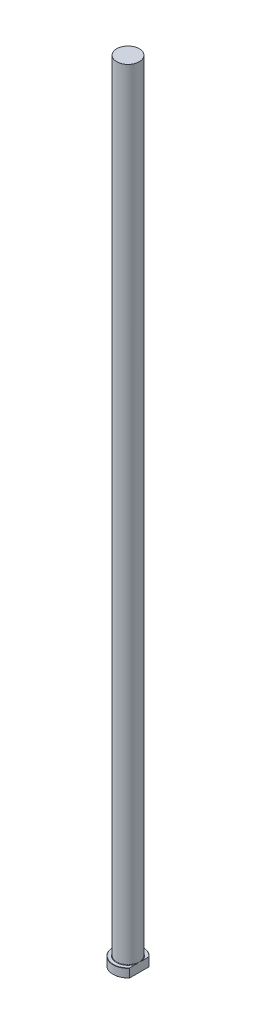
ISO-10303-21;
HEADER;
FILE_DESCRIPTION(('STEP AP214'),'2;1');
FILE_NAME('part.step','',(''),(''),'','','');
FILE_SCHEMA(('AUTOMOTIVE_DESIGN { 1 0 10303 214 1 1 1 1 }'));
ENDSEC;
DATA;
#1=APPLICATION_CONTEXT('core data for automotive mechanical design processes');
#2=APPLICATION_PROTOCOL_DEFINITION('international standard','automotive_design',2000,#1);
#3=PRODUCT_CONTEXT('',#1,'mechanical');
#4=PRODUCT('Part','Part','',(#3));
#5=PRODUCT_RELATED_PRODUCT_CATEGORY('part','',(#4));
#6=PRODUCT_DEFINITION_FORMATION('','',#4);
#7=PRODUCT_DEFINITION_CONTEXT('part definition',#1,'design');
#8=PRODUCT_DEFINITION('design','',#6,#7);
#9=PRODUCT_DEFINITION_SHAPE('','',#8);
#10=(LENGTH_UNIT() NAMED_UNIT(*) SI_UNIT(.MILLI.,.METRE.));
#11=(NAMED_UNIT(*) PLANE_ANGLE_UNIT() SI_UNIT($,.RADIAN.));
#12=(NAMED_UNIT(*) SI_UNIT($,.STERADIAN.) SOLID_ANGLE_UNIT());
#13=UNCERTAINTY_MEASURE_WITH_UNIT(LENGTH_MEASURE(1.E-05),#10,'distance_accuracy_value','');
#14=(GEOMETRIC_REPRESENTATION_CONTEXT(3) GLOBAL_UNCERTAINTY_ASSIGNED_CONTEXT((#13)) GLOBAL_UNIT_ASSIGNED_CONTEXT((#10,
#11,#12)) REPRESENTATION_CONTEXT('',''));
#15=CARTESIAN_POINT('',(0.,0.,0.));
#16=DIRECTION('',(0.,0.,1.));
#17=DIRECTION('',(1.,0.,0.));
#18=AXIS2_PLACEMENT_3D('',#15,#16,#17);
#19=CARTESIAN_POINT('',(0.,0.,0.));
#20=DIRECTION('',(0.,-1.,0.));
#21=DIRECTION('',(0.,0.,-1.));
#22=AXIS2_PLACEMENT_3D('',#19,#20,#21);
#23=PLANE('',#22);
#24=CARTESIAN_POINT('',(0.,0.,0.));
#25=DIRECTION('',(0.,-1.,0.));
#26=DIRECTION('',(0.,0.,-1.));
#27=AXIS2_PLACEMENT_3D('',#24,#25,#26);
#28=CIRCLE('',#27,11.7999999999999);
#29=CARTESIAN_POINT('',(8.99999999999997,0.,7.63151361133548));
#30=VERTEX_POINT('',#29);
#31=CARTESIAN_POINT('',(8.99999999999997,0.,-7.63151361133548));
#32=VERTEX_POINT('',#31);
#33=EDGE_CURVE('E98',#30,#32,#28,.T.);
#34=ORIENTED_EDGE('',*,*,#33,.T.);
#35=DIRECTION('',(0.,0.,1.));
#36=VECTOR('',#35,1.);
#37=CARTESIAN_POINT('',(8.99999999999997,0.,-7.93725393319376));
#38=LINE('',#37,#36);
#39=EDGE_CURVE('E83',#32,#30,#38,.T.);
#40=ORIENTED_EDGE('',*,*,#39,.T.);
#41=EDGE_LOOP('',(#34,#40));
#42=FACE_BOUND('',#41,.T.);
#43=ADVANCED_FACE('F32',(#42),#23,.T.);
#44=CARTESIAN_POINT('',(0.,259.958771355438,0.));
#45=DIRECTION('',(0.,1.,0.));
#46=DIRECTION('',(0.,0.,1.));
#47=AXIS2_PLACEMENT_3D('',#44,#45,#46);
#48=CYLINDRICAL_SURFACE('',#47,12.);
#49=CARTESIAN_POINT('',(0.,6.80000000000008,0.));
#50=DIRECTION('',(0.,1.,0.));
#51=DIRECTION('',(0.,0.,1.));
#52=AXIS2_PLACEMENT_3D('',#49,#50,#51);
#53=CIRCLE('',#52,12.);
#54=CARTESIAN_POINT('',(8.99999999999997,6.80000000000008,7.93725393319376));
#55=VERTEX_POINT('',#54);
#56=CARTESIAN_POINT('',(8.99999999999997,6.80000000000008,-7.93725393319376));
#57=VERTEX_POINT('',#56);
#58=EDGE_CURVE('E104',#55,#57,#53,.F.);
#59=ORIENTED_EDGE('',*,*,#58,.T.);
#60=DIRECTION('',(0.,-1.,0.));
#61=VECTOR('',#60,1.);
#62=CARTESIAN_POINT('',(8.99999999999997,630.,-7.93725393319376));
#63=LINE('',#62,#61);
#64=CARTESIAN_POINT('',(8.99999999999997,0.199999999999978,-7.93725393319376));
#65=VERTEX_POINT('',#64);
#66=EDGE_CURVE('E183',#57,#65,#63,.T.);
#67=ORIENTED_EDGE('',*,*,#66,.T.);
#68=CARTESIAN_POINT('',(0.,0.199999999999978,0.));
#69=DIRECTION('',(0.,-1.,0.));
#70=DIRECTION('',(0.,0.,-1.));
#71=AXIS2_PLACEMENT_3D('',#68,#69,#70);
#72=CIRCLE('',#71,12.);
#73=CARTESIAN_POINT('',(8.99999999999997,0.199999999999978,7.93725393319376));
#74=VERTEX_POINT('',#73);
#75=EDGE_CURVE('E100',#65,#74,#72,.F.);
#76=ORIENTED_EDGE('',*,*,#75,.T.);
#77=DIRECTION('',(0.,-1.,0.));
#78=VECTOR('',#77,1.);
#79=CARTESIAN_POINT('',(8.99999999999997,630.,7.93725393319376));
#80=LINE('',#79,#78);
#81=EDGE_CURVE('E93',#55,#74,#80,.T.);
#82=ORIENTED_EDGE('',*,*,#81,.F.);
#83=EDGE_LOOP('',(#59,#67,#76,#82));
#84=FACE_BOUND('',#83,.T.);
#85=ADVANCED_FACE('F158',(#84),#48,.T.);
#86=CARTESIAN_POINT('',(-12.,7.,0.));
#87=DIRECTION('',(0.,1.,0.));
#88=DIRECTION('',(0.,0.,1.));
#89=AXIS2_PLACEMENT_3D('',#86,#87,#88);
#90=PLANE('',#89);
#91=CARTESIAN_POINT('',(0.,7.,0.));
#92=DIRECTION('',(0.,1.,0.));
#93=DIRECTION('',(0.,0.,1.));
#94=AXIS2_PLACEMENT_3D('',#91,#92,#93);
#95=CIRCLE('',#94,11.8000000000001);
#96=CARTESIAN_POINT('',(8.99999999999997,7.,-7.63151361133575));
#97=VERTEX_POINT('',#96);
#98=CARTESIAN_POINT('',(8.99999999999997,7.,7.63151361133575));
#99=VERTEX_POINT('',#98);
#100=EDGE_CURVE('E178',#97,#99,#95,.T.);
#101=ORIENTED_EDGE('',*,*,#100,.T.);
#102=DIRECTION('',(0.,0.,-1.));
#103=VECTOR('',#102,1.);
#104=CARTESIAN_POINT('',(8.99999999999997,7.,0.));
#105=LINE('',#104,#103);
#106=CARTESIAN_POINT('',(8.99999999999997,6.99999999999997,2.34307490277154));
#107=VERTEX_POINT('',#106);
#108=EDGE_CURVE('E57',#99,#107,#105,.T.);
#109=ORIENTED_EDGE('',*,*,#108,.T.);
#110=CARTESIAN_POINT('',(0.,7.,0.));
#111=DIRECTION('',(0.,1.,0.));
#112=DIRECTION('',(0.,0.,1.));
#113=AXIS2_PLACEMENT_3D('',#110,#111,#112);
#114=CIRCLE('',#113,9.29999999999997);
#115=CARTESIAN_POINT('',(8.99999999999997,6.99999999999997,-2.34307490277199));
#116=VERTEX_POINT('',#115);
#117=EDGE_CURVE('E107',#107,#116,#114,.F.);
#118=ORIENTED_EDGE('',*,*,#117,.T.);
#119=EDGE_CURVE('E136',#116,#97,#105,.T.);
#120=ORIENTED_EDGE('',*,*,#119,.T.);
#121=EDGE_LOOP('',(#101,#109,#118,#120));
#122=FACE_BOUND('',#121,.T.);
#123=ADVANCED_FACE('F147',(#122),#90,.T.);
#124=CARTESIAN_POINT('',(0.,7.00000000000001,0.));
#125=DIRECTION('',(0.,-1.,0.));
#126=DIRECTION('',(0.,0.,-1.));
#127=AXIS2_PLACEMENT_3D('',#124,#125,#126);
#128=CONICAL_SURFACE('',#127,11.8000000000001,0.785398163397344);
#129=ORIENTED_EDGE('',*,*,#58,.F.);
#130=CARTESIAN_POINT('',(8.99999999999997,-0.845696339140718,17.4629145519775));
#131=CARTESIAN_POINT('',(8.99999999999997,-0.619168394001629,17.2080654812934));
#132=CARTESIAN_POINT('',(8.99999999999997,-0.393215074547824,16.9527052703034));
#133=CARTESIAN_POINT('',(8.99999999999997,0.0573779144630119,16.4408231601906));
#134=CARTESIAN_POINT('',(8.99999999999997,0.282017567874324,16.1843012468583));
#135=CARTESIAN_POINT('',(8.99999999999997,0.953874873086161,15.4126051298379));
#136=CARTESIAN_POINT('',(8.99999999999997,1.39886493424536,14.8954867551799));
#137=CARTESIAN_POINT('',(8.99999999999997,2.2870733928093,13.8475750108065));
#138=CARTESIAN_POINT('',(8.99999999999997,2.73018564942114,13.3166913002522));
#139=CARTESIAN_POINT('',(8.99999999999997,3.3866735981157,12.5137605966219));
#140=CARTESIAN_POINT('',(8.99999999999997,3.60411991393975,12.2450411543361));
#141=CARTESIAN_POINT('',(8.99999999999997,4.03580182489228,11.7050379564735));
#142=CARTESIAN_POINT('',(8.99999999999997,4.25003746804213,11.4337542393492));
#143=CARTESIAN_POINT('',(8.99999999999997,4.66485476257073,10.9008707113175));
#144=CARTESIAN_POINT('',(8.99999999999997,4.86560885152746,10.6394052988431));
#145=CARTESIAN_POINT('',(8.99999999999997,5.26299613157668,10.1133666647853));
#146=CARTESIAN_POINT('',(8.99999999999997,5.45962943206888,9.84879352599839));
#147=CARTESIAN_POINT('',(8.99999999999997,5.84808590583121,9.31586751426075));
#148=CARTESIAN_POINT('',(8.99999999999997,6.03990586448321,9.04751229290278));
#149=CARTESIAN_POINT('',(8.99999999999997,6.41755379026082,8.50661357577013));
#150=CARTESIAN_POINT('',(8.99999999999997,6.60338186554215,8.23407015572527));
#151=CARTESIAN_POINT('',(8.99999999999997,6.96709703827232,7.68503423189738));
#152=CARTESIAN_POINT('',(8.99999999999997,7.14500871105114,7.40855806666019));
#153=CARTESIAN_POINT('',(8.99999999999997,7.49185621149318,6.84996824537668));
#154=CARTESIAN_POINT('',(8.99999999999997,7.66079116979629,6.56785404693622));
#155=CARTESIAN_POINT('',(8.99999999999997,7.9872710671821,5.99747808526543));
#156=CARTESIAN_POINT('',(8.99999999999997,8.14482812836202,5.70922330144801));
#157=CARTESIAN_POINT('',(8.99999999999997,8.44586076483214,5.12549650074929));
#158=CARTESIAN_POINT('',(8.99999999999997,8.58934045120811,4.83002662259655));
#159=CARTESIAN_POINT('',(8.99999999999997,8.849064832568,4.25238874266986));
#160=CARTESIAN_POINT('',(8.99999999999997,8.96652090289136,3.97076984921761));
#161=CARTESIAN_POINT('',(8.99999999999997,9.1826864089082,3.40034514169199));
#162=CARTESIAN_POINT('',(8.99999999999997,9.28139598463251,3.11153938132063));
#163=CARTESIAN_POINT('',(8.99999999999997,9.45566763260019,2.52852903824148));
#164=CARTESIAN_POINT('',(8.99999999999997,9.53134480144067,2.23435935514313));
#165=CARTESIAN_POINT('',(8.99999999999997,9.65632576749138,1.64041484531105));
#166=CARTESIAN_POINT('',(8.99999999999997,9.70563300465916,1.34064075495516));
#167=CARTESIAN_POINT('',(8.99999999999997,9.77526514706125,0.733453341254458));
#168=CARTESIAN_POINT('',(8.99999999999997,9.7951781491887,0.425991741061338));
#169=CARTESIAN_POINT('',(8.99999999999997,9.80326622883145,-0.189338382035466));
#170=CARTESIAN_POINT('',(8.99999999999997,9.79144305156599,-0.497206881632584));
#171=CARTESIAN_POINT('',(8.99999999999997,9.73685194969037,-1.11106012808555));
#172=CARTESIAN_POINT('',(8.99999999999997,9.69399186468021,-1.41703652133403));
#173=CARTESIAN_POINT('',(8.99999999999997,9.58011156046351,-2.02367348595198));
#174=CARTESIAN_POINT('',(8.99999999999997,9.50908374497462,-2.32433260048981));
#175=CARTESIAN_POINT('',(8.99999999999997,9.31275981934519,-3.02635448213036));
#176=CARTESIAN_POINT('',(8.99999999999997,9.17712713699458,-3.42480429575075));
#177=CARTESIAN_POINT('',(8.99999999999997,8.87133996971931,-4.20817933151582));
#178=CARTESIAN_POINT('',(8.99999999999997,8.70116358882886,-4.59309579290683));
#179=CARTESIAN_POINT('',(8.99999999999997,8.42568509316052,-5.16277807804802));
#180=CARTESIAN_POINT('',(8.99999999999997,8.32997694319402,-5.35228814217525));
#181=CARTESIAN_POINT('',(8.99999999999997,8.13285287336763,-5.72832390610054));
#182=CARTESIAN_POINT('',(8.99999999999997,8.03143692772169,-5.91484959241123));
#183=CARTESIAN_POINT('',(8.99999999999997,7.82372693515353,-6.28506428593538));
#184=CARTESIAN_POINT('',(8.99999999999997,7.71743466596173,-6.46875429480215));
#185=CARTESIAN_POINT('',(8.99999999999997,7.50059460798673,-6.83359939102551));
#186=CARTESIAN_POINT('',(8.99999999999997,7.39004682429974,-7.01475448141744));
#187=CARTESIAN_POINT('',(8.99999999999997,7.12884885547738,-7.43306414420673));
#188=CARTESIAN_POINT('',(8.99999999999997,6.97680815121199,-7.66934990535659));
#189=CARTESIAN_POINT('',(8.99999999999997,6.66732030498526,-8.13836281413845));
#190=CARTESIAN_POINT('',(8.99999999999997,6.50987281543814,-8.37108973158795));
#191=CARTESIAN_POINT('',(8.99999999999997,6.19040265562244,-8.83345273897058));
#192=CARTESIAN_POINT('',(8.99999999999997,6.02837897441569,-9.06308812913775));
#193=CARTESIAN_POINT('',(8.99999999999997,5.70047733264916,-9.51959402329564));
#194=CARTESIAN_POINT('',(8.99999999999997,5.53459926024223,-9.7464644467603));
#195=CARTESIAN_POINT('',(8.99999999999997,5.03154469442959,-10.4241247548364));
#196=CARTESIAN_POINT('',(8.99999999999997,4.68944039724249,-10.8712583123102));
#197=CARTESIAN_POINT('',(8.99999999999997,3.99558068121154,-11.7578381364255));
#198=CARTESIAN_POINT('',(8.99999999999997,3.64382644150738,-12.197285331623));
#199=CARTESIAN_POINT('',(8.99999999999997,2.95317269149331,-13.0452636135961));
#200=CARTESIAN_POINT('',(8.99999999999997,2.61468309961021,-13.4541293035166));
#201=CARTESIAN_POINT('',(8.99999999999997,1.93249184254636,-14.2675092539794));
#202=CARTESIAN_POINT('',(8.99999999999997,1.58878996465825,-14.6720233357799));
#203=CARTESIAN_POINT('',(8.99999999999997,0.898519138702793,-15.4759626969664));
#204=CARTESIAN_POINT('',(8.99999999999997,0.551965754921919,-15.8754013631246));
#205=CARTESIAN_POINT('',(8.99999999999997,-0.144511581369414,-16.671264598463));
#206=CARTESIAN_POINT('',(8.99999999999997,-0.494435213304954,-17.0676894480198));
#207=CARTESIAN_POINT('',(8.99999999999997,-0.845696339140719,-17.4629145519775));
#208=B_SPLINE_CURVE_WITH_KNOTS('',3,(#130,#131,#132,#133,#134,#135,#136,#137,#138,#139,#140,
#141,#142,#143,#144,#145,#146,#147,#148,#149,#150,#151,#152,#153,#154,#155,#156,#157,#158,#159,
#160,#161,#162,#163,#164,#165,#166,#167,#168,#169,#170,#171,#172,#173,#174,#175,#176,#177,#178,
#179,#180,#181,#182,#183,#184,#185,#186,#187,#188,#189,#190,#191,#192,#193,#194,#195,#196,#197,
#198,#199,#200,#201,#202,#203,#204,#205,#206,#207),.UNSPECIFIED.,.F.,.F.,(4,2,2,2,2,2,2,2,2,2,2,
2,2,2,2,2,2,2,2,2,2,2,2,2,2,2,2,2,2,2,2,2,2,2,2,2,2,2,4),(0.,1.02291971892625,2.04585198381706,
4.09246471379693,6.16687312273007,7.20388686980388,8.24088509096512,9.22978878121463,
10.2186661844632,11.2081873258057,12.197690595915,13.183870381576,14.1701455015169,
15.1553538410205,16.1402736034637,17.0551241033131,17.9699677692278,18.8801617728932,
19.7902370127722,20.7129479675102,21.6356081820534,22.5610194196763,23.4866803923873,
24.747178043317,26.0084771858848,26.6453205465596,27.2821667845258,27.9187826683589,
28.555397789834,29.3982316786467,30.2411198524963,31.084195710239,31.9272960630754,
33.6160766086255,35.304651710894,36.896991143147,38.4893957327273,40.0758348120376,
41.6621244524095),.UNSPECIFIED.);
#209=EDGE_CURVE('E135',#55,#99,#208,.T.);
#210=ORIENTED_EDGE('',*,*,#209,.T.);
#211=ORIENTED_EDGE('',*,*,#100,.F.);
#212=EDGE_CURVE('E127',#97,#57,#208,.T.);
#213=ORIENTED_EDGE('',*,*,#212,.T.);
#214=EDGE_LOOP('',(#129,#210,#211,#213));
#215=FACE_BOUND('',#214,.T.);
#216=ADVANCED_FACE('F143',(#215),#128,.T.);
#217=CARTESIAN_POINT('',(0.,0.199999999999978,0.));
#218=DIRECTION('',(0.,1.,0.));
#219=DIRECTION('',(0.,0.,1.));
#220=AXIS2_PLACEMENT_3D('',#217,#218,#219);
#221=CONICAL_SURFACE('',#220,12.,0.785398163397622);
#222=ORIENTED_EDGE('',*,*,#75,.F.);
#223=CARTESIAN_POINT('',(8.99999999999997,7.84569633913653,-17.4629145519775));
#224=CARTESIAN_POINT('',(8.99999999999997,7.61916839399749,-17.2080654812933));
#225=CARTESIAN_POINT('',(8.99999999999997,7.39321507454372,-16.9527052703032));
#226=CARTESIAN_POINT('',(8.99999999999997,6.94262208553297,-16.4408231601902));
#227=CARTESIAN_POINT('',(8.99999999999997,6.7179824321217,-16.1843012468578));
#228=CARTESIAN_POINT('',(8.99999999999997,6.04612512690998,-15.4126051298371));
#229=CARTESIAN_POINT('',(8.99999999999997,5.60113506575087,-14.8954867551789));
#230=CARTESIAN_POINT('',(8.99999999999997,4.71292660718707,-13.8475750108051));
#231=CARTESIAN_POINT('',(8.99999999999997,4.26981435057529,-13.3166913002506));
#232=CARTESIAN_POINT('',(8.99999999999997,3.61332640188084,-12.5137605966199));
#233=CARTESIAN_POINT('',(8.99999999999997,3.39588008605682,-12.245041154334));
#234=CARTESIAN_POINT('',(8.99999999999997,2.96419817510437,-11.7050379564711));
#235=CARTESIAN_POINT('',(8.99999999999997,2.74996253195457,-11.4337542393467));
#236=CARTESIAN_POINT('',(8.99999999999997,2.33514523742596,-10.9008707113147));
#237=CARTESIAN_POINT('',(8.99999999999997,2.1343911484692,-10.6394052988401));
#238=CARTESIAN_POINT('',(8.99999999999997,1.73700386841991,-10.1133666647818));
#239=CARTESIAN_POINT('',(8.99999999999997,1.54037056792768,-9.84879352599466));
#240=CARTESIAN_POINT('',(8.99999999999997,1.1519140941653,-9.31586751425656));
#241=CARTESIAN_POINT('',(8.99999999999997,0.960094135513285,-9.04751229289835));
#242=CARTESIAN_POINT('',(8.99999999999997,0.582446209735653,-8.50661357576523));
#243=CARTESIAN_POINT('',(8.99999999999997,0.396618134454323,-8.23407015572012));
#244=CARTESIAN_POINT('',(8.99999999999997,0.0329029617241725,-7.68503423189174));
#245=CARTESIAN_POINT('',(8.99999999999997,-0.145008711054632,-7.40855806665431));
#246=CARTESIAN_POINT('',(8.99999999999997,-0.491856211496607,-6.8499682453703));
#247=CARTESIAN_POINT('',(8.99999999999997,-0.66079116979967,-6.56785404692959));
#248=CARTESIAN_POINT('',(8.99999999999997,-0.987271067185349,-5.99747808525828));
#249=CARTESIAN_POINT('',(8.99999999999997,-1.14482812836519,-5.70922330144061));
#250=CARTESIAN_POINT('',(8.99999999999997,-1.4458607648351,-5.12549650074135));
#251=CARTESIAN_POINT('',(8.99999999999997,-1.58934045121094,-4.83002662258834));
#252=CARTESIAN_POINT('',(8.99999999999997,-1.84906483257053,-4.25238874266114));
#253=CARTESIAN_POINT('',(8.99999999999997,-1.96652090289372,-3.97076984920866));
#254=CARTESIAN_POINT('',(8.99999999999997,-2.18268640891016,-3.40034514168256));
#255=CARTESIAN_POINT('',(8.99999999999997,-2.28139598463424,-3.11153938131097));
#256=CARTESIAN_POINT('',(8.99999999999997,-2.4556676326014,-2.52852903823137));
#257=CARTESIAN_POINT('',(8.99999999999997,-2.5313448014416,-2.23435935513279));
#258=CARTESIAN_POINT('',(8.99999999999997,-2.65632576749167,-1.64041484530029));
#259=CARTESIAN_POINT('',(8.99999999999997,-2.70563300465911,-1.3406407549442));
#260=CARTESIAN_POINT('',(8.99999999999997,-2.77526514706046,-0.733453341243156));
#261=CARTESIAN_POINT('',(8.99999999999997,-2.79517814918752,-0.425991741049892));
#262=CARTESIAN_POINT('',(8.99999999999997,-2.80326622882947,0.189338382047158));
#263=CARTESIAN_POINT('',(8.99999999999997,-2.79144305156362,0.497206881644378));
#264=CARTESIAN_POINT('',(8.99999999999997,-2.73685194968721,1.11106012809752));
#265=CARTESIAN_POINT('',(8.99999999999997,-2.69399186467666,1.41703652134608));
#266=CARTESIAN_POINT('',(8.99999999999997,-2.58011156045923,2.02367348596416));
#267=CARTESIAN_POINT('',(8.99999999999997,-2.50908374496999,2.32433260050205));
#268=CARTESIAN_POINT('',(8.99999999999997,-2.31275981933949,3.02635448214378));
#269=CARTESIAN_POINT('',(8.99999999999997,-2.17712713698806,3.42480429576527));
#270=CARTESIAN_POINT('',(8.99999999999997,-1.87133996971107,4.20817933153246));
#271=CARTESIAN_POINT('',(8.99999999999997,-1.70116358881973,4.59309579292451));
#272=CARTESIAN_POINT('',(8.99999999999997,-1.42568509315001,5.1627780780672));
#273=CARTESIAN_POINT('',(8.99999999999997,-1.32997694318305,5.35228814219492));
#274=CARTESIAN_POINT('',(8.99999999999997,-1.13285287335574,5.7283239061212));
#275=CARTESIAN_POINT('',(8.99999999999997,-1.03143692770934,5.91484959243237));
#276=CARTESIAN_POINT('',(8.99999999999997,-0.823726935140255,6.28506428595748));
#277=CARTESIAN_POINT('',(8.99999999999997,-0.717434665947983,6.46875429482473));
#278=CARTESIAN_POINT('',(8.99999999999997,-0.500594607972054,6.83359939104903));
#279=CARTESIAN_POINT('',(8.99999999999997,-0.390046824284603,7.01475448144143));
#280=CARTESIAN_POINT('',(8.99999999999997,-0.12884885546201,7.43306414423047));
#281=CARTESIAN_POINT('',(8.99999999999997,0.0231918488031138,7.66934990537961));
#282=CARTESIAN_POINT('',(8.99999999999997,0.332679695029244,8.13836281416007));
#283=CARTESIAN_POINT('',(8.99999999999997,0.490127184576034,8.37108973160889));
#284=CARTESIAN_POINT('',(8.99999999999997,0.80959734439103,8.83345273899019));
#285=CARTESIAN_POINT('',(8.99999999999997,0.971621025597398,9.0630881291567));
#286=CARTESIAN_POINT('',(8.99999999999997,1.29952266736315,9.51959402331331));
#287=CARTESIAN_POINT('',(8.99999999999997,1.46540073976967,9.74646444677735));
#288=CARTESIAN_POINT('',(8.99999999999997,1.96845530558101,10.4241247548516));
#289=CARTESIAN_POINT('',(8.99999999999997,2.31055960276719,10.8712583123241));
#290=CARTESIAN_POINT('',(8.99999999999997,3.00441931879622,11.7578381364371));
#291=CARTESIAN_POINT('',(8.99999999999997,3.35617355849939,12.1972853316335));
#292=CARTESIAN_POINT('',(8.99999999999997,4.04682730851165,13.0452636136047));
#293=CARTESIAN_POINT('',(8.99999999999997,4.38531690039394,13.4541293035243));
#294=CARTESIAN_POINT('',(8.99999999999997,5.06750815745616,14.2675092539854));
#295=CARTESIAN_POINT('',(8.99999999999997,5.41121003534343,14.6720233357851));
#296=CARTESIAN_POINT('',(8.99999999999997,6.10148086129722,15.4759626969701));
#297=CARTESIAN_POINT('',(8.99999999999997,6.44803424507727,15.8754013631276));
#298=CARTESIAN_POINT('',(8.99999999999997,7.14451158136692,16.6712645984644));
#299=CARTESIAN_POINT('',(8.99999999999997,7.49443521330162,17.0676894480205));
#300=CARTESIAN_POINT('',(8.99999999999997,7.84569633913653,17.4629145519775));
#301=B_SPLINE_CURVE_WITH_KNOTS('',3,(#223,#224,#225,#226,#227,#228,#229,#230,#231,#232,#233,
#234,#235,#236,#237,#238,#239,#240,#241,#242,#243,#244,#245,#246,#247,#248,#249,#250,#251,#252,
#253,#254,#255,#256,#257,#258,#259,#260,#261,#262,#263,#264,#265,#266,#267,#268,#269,#270,#271,
#272,#273,#274,#275,#276,#277,#278,#279,#280,#281,#282,#283,#284,#285,#286,#287,#288,#289,#290,
#291,#292,#293,#294,#295,#296,#297,#298,#299,#300),.UNSPECIFIED.,.F.,.F.,(4,2,2,2,2,2,2,2,2,2,2,
2,2,2,2,2,2,2,2,2,2,2,2,2,2,2,2,2,2,2,2,2,2,2,2,2,2,2,4),(0.,1.02291971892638,2.04585198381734,
4.09246471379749,6.16687312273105,7.20388686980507,8.24088509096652,9.22978878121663,
10.2186661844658,11.208187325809,12.1976905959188,13.1838703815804,14.1701455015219,
15.1553538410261,16.1402736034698,17.0551241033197,17.9699677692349,18.8801617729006,
19.79023701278,20.7129479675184,21.6356081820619,22.5610194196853,23.4866803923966,
24.7471780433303,26.008477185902,26.6453205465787,27.2821667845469,27.9187826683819,
28.555397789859,29.3982316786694,30.2411198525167,31.0841957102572,31.9272960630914,
33.6160766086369,35.3046517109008,36.8969911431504,38.4893957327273,40.0758348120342,
41.6621244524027),.UNSPECIFIED.);
#302=EDGE_CURVE('E86',#65,#32,#301,.T.);
#303=ORIENTED_EDGE('',*,*,#302,.T.);
#304=ORIENTED_EDGE('',*,*,#33,.F.);
#305=EDGE_CURVE('E89',#30,#74,#301,.T.);
#306=ORIENTED_EDGE('',*,*,#305,.T.);
#307=EDGE_LOOP('',(#222,#303,#304,#306));
#308=FACE_BOUND('',#307,.T.);
#309=ADVANCED_FACE('F97',(#308),#221,.T.);
#310=CARTESIAN_POINT('',(0.,7.29999999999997,0.));
#311=DIRECTION('',(0.,1.,0.));
#312=DIRECTION('',(0.,0.,1.));
#313=AXIS2_PLACEMENT_3D('',#310,#311,#312);
#314=TOROIDAL_SURFACE('',#313,9.29999999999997,0.3);
#315=CARTESIAN_POINT('',(8.99999999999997,7.29999999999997,0.));
#316=CARTESIAN_POINT('',(8.99999999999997,7.30000063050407,1.40628521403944E-10));
#317=CARTESIAN_POINT('',(8.99999999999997,7.30000126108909,-3.72953344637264E-07));
#318=CARTESIAN_POINT('',(8.99999999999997,7.30000242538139,-1.31879172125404E-06));
#319=CARTESIAN_POINT('',(8.99999999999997,7.30000291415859,-1.91658985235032E-06));
#320=CARTESIAN_POINT('',(8.99999999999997,7.30000399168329,-3.38116402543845E-06));
#321=CARTESIAN_POINT('',(8.99999999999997,7.30000455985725,-4.27141237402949E-06));
#322=CARTESIAN_POINT('',(8.99999999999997,7.30000552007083,-6.05655817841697E-06));
#323=CARTESIAN_POINT('',(8.99999999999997,7.30000592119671,-6.9473471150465E-06));
#324=CARTESIAN_POINT('',(8.99999999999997,7.30000753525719,-1.06072217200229E-05));
#325=CARTESIAN_POINT('',(8.99999999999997,7.30000869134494,-1.34079715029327E-05));
#326=CARTESIAN_POINT('',(8.99999999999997,7.30001046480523,-1.87883419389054E-05));
#327=CARTESIAN_POINT('',(8.99999999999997,7.30001113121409,-2.13522964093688E-05));
#328=CARTESIAN_POINT('',(8.99999999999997,7.30001412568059,-3.27400407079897E-05));
#329=CARTESIAN_POINT('',(8.99999999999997,7.30001653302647,-4.15431816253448E-05));
#330=CARTESIAN_POINT('',(8.99999999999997,7.30001987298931,-5.77938726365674E-05));
#331=CARTESIAN_POINT('',(8.99999999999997,7.3000209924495,-6.5202010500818E-05));
#332=CARTESIAN_POINT('',(8.99999999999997,7.30002942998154,-0.000121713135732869));
#333=CARTESIAN_POINT('',(8.99999999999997,7.30003617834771,-0.000170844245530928));
#334=CARTESIAN_POINT('',(8.99999999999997,7.30006567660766,-0.00036702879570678));
#335=CARTESIAN_POINT('',(8.99999999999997,7.30009343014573,-0.00051334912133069));
#336=CARTESIAN_POINT('',(8.99999999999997,7.30020289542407,-0.00109844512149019));
#337=CARTESIAN_POINT('',(8.99999999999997,7.30028164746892,-0.00153755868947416));
#338=CARTESIAN_POINT('',(8.99999999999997,7.30059984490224,-0.00330079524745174));
#339=CARTESIAN_POINT('',(8.99999999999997,7.30084318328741,-0.00462444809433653));
#340=CARTESIAN_POINT('',(8.99999999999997,7.30186346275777,-0.0101867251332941));
#341=CARTESIAN_POINT('',(8.99999999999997,7.30263548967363,-0.0144259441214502));
#342=CARTESIAN_POINT('',(8.99999999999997,7.31325744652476,-0.0727359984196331));
#343=CARTESIAN_POINT('',(8.99999999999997,7.32313962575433,-0.1268031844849));
#344=CARTESIAN_POINT('',(8.99999999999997,7.34392153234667,-0.241097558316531));
#345=CARTESIAN_POINT('',(8.99999999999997,7.35480932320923,-0.301326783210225));
#346=CARTESIAN_POINT('',(8.99999999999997,7.37309736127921,-0.40343148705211));
#347=CARTESIAN_POINT('',(8.99999999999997,7.3805477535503,-0.445297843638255));
#348=CARTESIAN_POINT('',(8.99999999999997,7.39510453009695,-0.527858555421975));
#349=CARTESIAN_POINT('',(8.99999999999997,7.40221466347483,-0.568552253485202));
#350=CARTESIAN_POINT('',(8.99999999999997,7.43458159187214,-0.755924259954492));
#351=CARTESIAN_POINT('',(8.99999999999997,7.45890071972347,-0.902767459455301));
#352=CARTESIAN_POINT('',(8.99999999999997,7.5040883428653,-1.19870226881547));
#353=CARTESIAN_POINT('',(8.99999999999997,7.52491482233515,-1.34780055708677));
#354=CARTESIAN_POINT('',(8.99999999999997,7.55251893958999,-1.57943061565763));
#355=CARTESIAN_POINT('',(8.99999999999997,7.56140010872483,-1.66170929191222));
#356=CARTESIAN_POINT('',(8.99999999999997,7.57684365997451,-1.82648173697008));
#357=CARTESIAN_POINT('',(8.99999999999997,7.58340627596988,-1.90897548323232));
#358=CARTESIAN_POINT('',(8.99999999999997,7.59356547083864,-2.07383798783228));
#359=CARTESIAN_POINT('',(8.99999999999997,7.59717316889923,-2.15620603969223));
#360=CARTESIAN_POINT('',(8.99999999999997,7.60060935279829,-2.32101209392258));
#361=CARTESIAN_POINT('',(8.99999999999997,7.60043940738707,-2.40345005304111));
#362=CARTESIAN_POINT('',(8.99999999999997,7.59640131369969,-2.52537573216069));
#363=CARTESIAN_POINT('',(8.99999999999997,7.59450012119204,-2.56492910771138));
#364=CARTESIAN_POINT('',(8.99999999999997,7.58928802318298,-2.64396909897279));
#365=CARTESIAN_POINT('',(8.99999999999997,7.58597630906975,-2.68345566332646));
#366=CARTESIAN_POINT('',(8.99999999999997,7.57769868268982,-2.76177296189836));
#367=CARTESIAN_POINT('',(8.99999999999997,7.57275348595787,-2.80060581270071));
#368=CARTESIAN_POINT('',(8.99999999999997,7.56078540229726,-2.87793166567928));
#369=CARTESIAN_POINT('',(8.99999999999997,7.55376374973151,-2.91642485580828));
#370=CARTESIAN_POINT('',(8.99999999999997,7.53694450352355,-2.99313780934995));
#371=CARTESIAN_POINT('',(8.99999999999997,7.52712658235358,-3.03135338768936));
#372=CARTESIAN_POINT('',(8.99999999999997,7.50944673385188,-3.08780831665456));
#373=CARTESIAN_POINT('',(8.99999999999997,7.50305127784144,-3.10650508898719));
#374=CARTESIAN_POINT('',(8.99999999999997,7.48902548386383,-3.14342466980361));
#375=CARTESIAN_POINT('',(8.99999999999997,7.48139609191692,-3.16164782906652));
#376=CARTESIAN_POINT('',(8.99999999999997,7.46450585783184,-3.19743301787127));
#377=CARTESIAN_POINT('',(8.99999999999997,7.4552376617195,-3.2149916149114));
#378=CARTESIAN_POINT('',(8.99999999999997,7.43454972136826,-3.24876333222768));
#379=CARTESIAN_POINT('',(8.99999999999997,7.42314087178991,-3.26498269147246));
#380=CARTESIAN_POINT('',(8.99999999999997,7.40450419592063,-3.28646803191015));
#381=CARTESIAN_POINT('',(8.99999999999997,7.39850345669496,-3.29278935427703));
#382=CARTESIAN_POINT('',(8.99999999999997,7.38579421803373,-3.30471156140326));
#383=CARTESIAN_POINT('',(8.99999999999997,7.37908470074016,-3.31031138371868));
#384=CARTESIAN_POINT('',(8.99999999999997,7.36478588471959,-3.32053638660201));
#385=CARTESIAN_POINT('',(8.99999999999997,7.35718475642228,-3.32514544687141));
#386=CARTESIAN_POINT('',(8.99999999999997,7.34122980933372,-3.33278362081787));
#387=CARTESIAN_POINT('',(8.99999999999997,7.33287931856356,-3.33581935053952));
#388=CARTESIAN_POINT('',(8.99999999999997,7.31845330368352,-3.33919143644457));
#389=CARTESIAN_POINT('',(8.99999999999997,7.3125065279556,-3.34008113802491));
#390=CARTESIAN_POINT('',(8.99999999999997,7.30054756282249,-3.34082795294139));
#391=CARTESIAN_POINT('',(8.99999999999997,7.29453539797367,-3.34068544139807));
#392=CARTESIAN_POINT('',(8.99999999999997,7.28263753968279,-3.33938340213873));
#393=CARTESIAN_POINT('',(8.99999999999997,7.2767516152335,-3.3382259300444));
#394=CARTESIAN_POINT('',(8.99999999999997,7.26523345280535,-3.33500803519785));
#395=CARTESIAN_POINT('',(8.99999999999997,7.25960143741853,-3.33294683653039));
#396=CARTESIAN_POINT('',(8.99999999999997,7.24614810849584,-3.32695048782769));
#397=CARTESIAN_POINT('',(8.99999999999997,7.23851777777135,-3.32258952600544));
#398=CARTESIAN_POINT('',(8.99999999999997,7.22402940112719,-3.31273429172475));
#399=CARTESIAN_POINT('',(8.99999999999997,7.21717355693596,-3.3072369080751));
#400=CARTESIAN_POINT('',(8.99999999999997,7.19922025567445,-3.29098261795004));
#401=CARTESIAN_POINT('',(8.99999999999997,7.18887056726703,-3.27940951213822));
#402=CARTESIAN_POINT('',(8.99999999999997,7.16988044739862,-3.25496698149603));
#403=CARTESIAN_POINT('',(8.99999999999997,7.16124389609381,-3.24209471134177));
#404=CARTESIAN_POINT('',(8.99999999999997,7.14198013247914,-3.2101081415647));
#405=CARTESIAN_POINT('',(8.99999999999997,7.1320002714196,-3.1906083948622));
#406=CARTESIAN_POINT('',(8.99999999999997,7.11389041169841,-3.15075380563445));
#407=CARTESIAN_POINT('',(8.99999999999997,7.10576438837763,-3.13039723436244));
#408=CARTESIAN_POINT('',(8.99999999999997,7.09086324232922,-3.08897345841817));
#409=CARTESIAN_POINT('',(8.99999999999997,7.08410231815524,-3.06790120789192));
#410=CARTESIAN_POINT('',(8.99999999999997,7.07174209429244,-3.02545099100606));
#411=CARTESIAN_POINT('',(8.99999999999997,7.06614150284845,-3.00407339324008));
#412=CARTESIAN_POINT('',(8.99999999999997,7.05234584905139,-2.94629140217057));
#413=CARTESIAN_POINT('',(8.99999999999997,7.04502112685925,-2.90967972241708));
#414=CARTESIAN_POINT('',(8.99999999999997,7.03240402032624,-2.8361022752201));
#415=CARTESIAN_POINT('',(8.99999999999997,7.02711280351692,-2.79913631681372));
#416=CARTESIAN_POINT('',(8.99999999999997,7.01363050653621,-2.68772710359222));
#417=CARTESIAN_POINT('',(8.99999999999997,7.00787651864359,-2.61298996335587));
#418=CARTESIAN_POINT('',(8.99999999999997,7.00101064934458,-2.46619763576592));
#419=CARTESIAN_POINT('',(8.99999999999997,6.99973066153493,-2.39414846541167));
#420=CARTESIAN_POINT('',(8.99999999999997,7.0003597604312,-2.25048360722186));
#421=CARTESIAN_POINT('',(8.99999999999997,7.00225057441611,-2.17886780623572));
#422=CARTESIAN_POINT('',(8.99999999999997,7.00865827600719,-2.0325544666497));
#423=CARTESIAN_POINT('',(8.99999999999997,7.01328875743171,-1.95786225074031));
#424=CARTESIAN_POINT('',(8.99999999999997,7.0247141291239,-1.80868969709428));
#425=CARTESIAN_POINT('',(8.99999999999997,7.03150781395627,-1.73420926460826));
#426=CARTESIAN_POINT('',(8.99999999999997,7.04702589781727,-1.583650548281));
#427=CARTESIAN_POINT('',(8.99999999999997,7.05579262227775,-1.50757669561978));
#428=CARTESIAN_POINT('',(8.99999999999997,7.07482366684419,-1.35540828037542));
#429=CARTESIAN_POINT('',(8.99999999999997,7.08509200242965,-1.27931422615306));
#430=CARTESIAN_POINT('',(8.99999999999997,7.11096614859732,-1.09814766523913));
#431=CARTESIAN_POINT('',(8.99999999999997,7.12710877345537,-0.993152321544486));
#432=CARTESIAN_POINT('',(8.99999999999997,7.16076002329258,-0.784642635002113));
#433=CARTESIAN_POINT('',(8.99999999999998,7.17825049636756,-0.681125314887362));
#434=CARTESIAN_POINT('',(8.99999999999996,7.21207189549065,-0.486473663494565));
#435=CARTESIAN_POINT('',(8.99999999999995,7.22829584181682,-0.395320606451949));
#436=CARTESIAN_POINT('',(8.99999999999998,7.25335230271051,-0.256199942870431));
#437=CARTESIAN_POINT('',(9.,7.26204965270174,-0.208207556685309));
#438=CARTESIAN_POINT('',(8.99999999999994,7.27937243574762,-0.113033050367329));
#439=CARTESIAN_POINT('',(8.99999999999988,7.2879966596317,-0.0658507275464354));
#440=CARTESIAN_POINT('',(8.99999999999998,7.29736684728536,-0.0144131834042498));
#441=CARTESIAN_POINT('',(8.99999999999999,7.29814117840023,-0.0101611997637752));
#442=CARTESIAN_POINT('',(8.99999999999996,7.29916198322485,-0.00459610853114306));
#443=CARTESIAN_POINT('',(8.99999999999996,7.29940349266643,-0.00328239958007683));
#444=CARTESIAN_POINT('',(8.99999999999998,7.29971946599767,-0.00153148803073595));
#445=CARTESIAN_POINT('',(8.99999999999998,7.2997977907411,-0.00109475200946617));
#446=CARTESIAN_POINT('',(8.99999999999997,7.29990674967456,-0.000512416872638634));
#447=CARTESIAN_POINT('',(8.99999999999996,7.29993443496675,-0.000366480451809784));
#448=CARTESIAN_POINT('',(8.99999999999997,7.29996386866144,-0.00017073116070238));
#449=CARTESIAN_POINT('',(8.99999999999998,7.29997060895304,-0.000121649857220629));
#450=CARTESIAN_POINT('',(8.99999999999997,7.29997903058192,-6.51901500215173E-05));
#451=CARTESIAN_POINT('',(8.99999999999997,7.29998014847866,-5.7784383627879E-05));
#452=CARTESIAN_POINT('',(8.99999999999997,7.29998348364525,-4.15389236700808E-05));
#453=CARTESIAN_POINT('',(8.99999999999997,7.29998588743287,-3.27385309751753E-05));
#454=CARTESIAN_POINT('',(8.99999999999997,7.29998887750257,-2.13537218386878E-05));
#455=CARTESIAN_POINT('',(8.99999999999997,7.29998954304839,-1.87899411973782E-05));
#456=CARTESIAN_POINT('',(8.99999999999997,7.29999131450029,-1.34098146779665E-05));
#457=CARTESIAN_POINT('',(8.99999999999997,7.29999246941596,-1.0609109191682E-05));
#458=CARTESIAN_POINT('',(8.99999999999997,7.29999408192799,-6.94916941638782E-06));
#459=CARTESIAN_POINT('',(8.99999999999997,7.29999448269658,-6.05831006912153E-06));
#460=CARTESIAN_POINT('',(8.99999999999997,7.29999544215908,-4.27295929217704E-06));
#461=CARTESIAN_POINT('',(8.99999999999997,7.29999600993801,-3.38257168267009E-06));
#462=CARTESIAN_POINT('',(8.99999999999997,7.29999708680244,-1.91768845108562E-06));
#463=CARTESIAN_POINT('',(8.99999999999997,7.29999757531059,-1.3197344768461E-06));
#464=CARTESIAN_POINT('',(8.99999999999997,7.29999873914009,-3.73475936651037E-07));
#465=CARTESIAN_POINT('',(8.99999999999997,7.29999936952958,-1.40621003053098E-10));
#466=CARTESIAN_POINT('',(8.99999999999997,7.29999999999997,0.));
#467=B_SPLINE_CURVE_WITH_KNOTS('',3,(#315,#316,#317,#318,#319,#320,#321,#322,#323,#324,#325,
#326,#327,#328,#329,#330,#331,#332,#333,#334,#335,#336,#337,#338,#339,#340,#341,#342,#343,#344,
#345,#346,#347,#348,#349,#350,#351,#352,#353,#354,#355,#356,#357,#358,#359,#360,#361,#362,#363,
#364,#365,#366,#367,#368,#369,#370,#371,#372,#373,#374,#375,#376,#377,#378,#379,#380,#381,#382,
#383,#384,#385,#386,#387,#388,#389,#390,#391,#392,#393,#394,#395,#396,#397,#398,#399,#400,#401,
#402,#403,#404,#405,#406,#407,#408,#409,#410,#411,#412,#413,#414,#415,#416,#417,#418,#419,#420,
#421,#422,#423,#424,#425,#426,#427,#428,#429,#430,#431,#432,#433,#434,#435,#436,#437,#438,#439,
#440,#441,#442,#443,#444,#445,#446,#447,#448,#449,#450,#451,#452,#453,#454,#455,#456,#457,#458,
#459,#460,#461,#462,#463,#464,#465,#466),.UNSPECIFIED.,.T.,.F.,(4,2,2,2,2,2,2,2,2,2,2,2,2,2,2,2,
2,2,2,2,2,2,2,2,2,2,2,2,2,2,2,2,2,2,2,2,2,2,2,2,2,2,2,2,2,2,2,2,2,2,2,2,2,2,2,2,2,2,2,2,2,2,2,2,
2,2,2,2,2,2,2,2,2,2,2,4),(0.,1.9618165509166E-06,4.31785402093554E-06,7.45492696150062E-06,
1.03869199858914E-05,1.94514161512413E-05,2.73914962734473E-05,5.47432539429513E-05,
7.71990234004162E-05,0.000226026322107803,0.000672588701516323,0.00201119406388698,
0.00604839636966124,0.0189755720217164,0.183861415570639,0.367478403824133,0.495050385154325,
0.618980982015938,1.06548941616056,1.51703428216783,1.76527968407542,2.01350003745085,
2.26078200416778,2.50796128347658,2.62673893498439,2.74558477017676,2.86297785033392,
2.98030128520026,3.09850038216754,3.15775069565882,3.2169557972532,3.27643364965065,
3.33561662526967,3.36172163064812,3.38786464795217,3.41440531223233,3.4408334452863,
3.45879041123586,3.47674085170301,3.49465502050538,3.51258460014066,3.53879954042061,
3.56508722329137,3.61140219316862,3.65782089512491,3.72337768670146,3.78907376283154,
3.85542145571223,3.92169488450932,4.03362051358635,4.14561030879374,4.37025392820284,
4.58636028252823,4.80122553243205,5.02569406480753,5.25003773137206,5.47975187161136,
5.71009192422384,6.02876014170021,6.3437072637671,6.62146210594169,6.76778501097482,
6.91167467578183,6.92464076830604,6.92864764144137,6.92997899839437,6.93042439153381,
6.93057306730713,6.93059551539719,6.93062285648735,6.93063079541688,6.93063985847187,
6.93064279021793,6.93064592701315,6.93064828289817,6.93065024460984),.UNSPECIFIED.);
#468=CARTESIAN_POINT('',(8.99999999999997,7.29999999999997,0.));
#469=VERTEX_POINT('',#468);
#470=EDGE_CURVE('E11',#116,#469,#467,.T.);
#471=ORIENTED_EDGE('',*,*,#470,.F.);
#472=ORIENTED_EDGE('',*,*,#117,.F.);
#473=CARTESIAN_POINT('',(8.99999999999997,7.29999999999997,0.));
#474=CARTESIAN_POINT('',(8.99999999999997,7.29999936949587,-1.40628685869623E-10));
#475=CARTESIAN_POINT('',(8.99999999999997,7.29999873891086,3.72953344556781E-07));
#476=CARTESIAN_POINT('',(8.99999999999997,7.29999757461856,1.31879172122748E-06));
#477=CARTESIAN_POINT('',(8.99999999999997,7.29999708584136,1.9165898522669E-06));
#478=CARTESIAN_POINT('',(8.99999999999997,7.29999600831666,3.3811640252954E-06));
#479=CARTESIAN_POINT('',(8.99999999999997,7.2999954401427,4.27141237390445E-06));
#480=CARTESIAN_POINT('',(8.99999999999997,7.29999447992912,6.05655817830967E-06));
#481=CARTESIAN_POINT('',(8.99999999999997,7.29999407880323,6.94734711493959E-06));
#482=CARTESIAN_POINT('',(8.99999999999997,7.29999246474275,1.06072217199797E-05));
#483=CARTESIAN_POINT('',(8.99999999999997,7.299991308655,1.34079715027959E-05));
#484=CARTESIAN_POINT('',(8.99999999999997,7.29998953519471,1.87883419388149E-05));
#485=CARTESIAN_POINT('',(8.99999999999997,7.29998886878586,2.13522964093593E-05));
#486=CARTESIAN_POINT('',(8.99999999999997,7.29998587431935,3.2740040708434E-05));
#487=CARTESIAN_POINT('',(8.99999999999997,7.29998346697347,4.15431816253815E-05));
#488=CARTESIAN_POINT('',(8.99999999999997,7.29998012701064,5.77938726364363E-05));
#489=CARTESIAN_POINT('',(8.99999999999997,7.29997900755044,6.52020105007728E-05));
#490=CARTESIAN_POINT('',(8.99999999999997,7.29997057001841,0.000121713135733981));
#491=CARTESIAN_POINT('',(8.99999999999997,7.29996382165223,0.000170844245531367));
#492=CARTESIAN_POINT('',(8.99999999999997,7.29993432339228,0.000367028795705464));
#493=CARTESIAN_POINT('',(8.99999999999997,7.29990656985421,0.000513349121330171));
#494=CARTESIAN_POINT('',(8.99999999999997,7.29979710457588,0.00109844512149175));
#495=CARTESIAN_POINT('',(8.99999999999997,7.29971835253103,0.00153755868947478));
#496=CARTESIAN_POINT('',(8.99999999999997,7.29940015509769,0.00330079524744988));
#497=CARTESIAN_POINT('',(8.99999999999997,7.29915681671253,0.00462444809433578));
#498=CARTESIAN_POINT('',(8.99999999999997,7.29813653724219,0.0101867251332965));
#499=CARTESIAN_POINT('',(8.99999999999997,7.29736451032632,0.0144259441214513));
#500=CARTESIAN_POINT('',(8.99999999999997,7.28674255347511,0.0727359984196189));
#501=CARTESIAN_POINT('',(8.99999999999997,7.27686037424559,0.126803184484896));
#502=CARTESIAN_POINT('',(8.99999999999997,7.2560784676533,0.241097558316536));
#503=CARTESIAN_POINT('',(8.99999999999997,7.24519067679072,0.301326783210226));
#504=CARTESIAN_POINT('',(8.99999999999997,7.22690263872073,0.403431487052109));
#505=CARTESIAN_POINT('',(8.99999999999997,7.21945224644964,0.445297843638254));
#506=CARTESIAN_POINT('',(8.99999999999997,7.204895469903,0.527858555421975));
#507=CARTESIAN_POINT('',(8.99999999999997,7.19778533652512,0.568552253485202));
#508=CARTESIAN_POINT('',(8.99999999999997,7.1654184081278,0.755924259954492));
#509=CARTESIAN_POINT('',(8.99999999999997,7.14109928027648,0.902767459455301));
#510=CARTESIAN_POINT('',(8.99999999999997,7.09591165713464,1.19870226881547));
#511=CARTESIAN_POINT('',(8.99999999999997,7.0750851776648,1.34780055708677));
#512=CARTESIAN_POINT('',(8.99999999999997,7.04748106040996,1.57943061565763));
#513=CARTESIAN_POINT('',(8.99999999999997,7.03859989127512,1.66170929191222));
#514=CARTESIAN_POINT('',(8.99999999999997,7.02315634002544,1.82648173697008));
#515=CARTESIAN_POINT('',(8.99999999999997,7.01659372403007,1.90897548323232));
#516=CARTESIAN_POINT('',(8.99999999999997,7.00643452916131,2.07383798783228));
#517=CARTESIAN_POINT('',(8.99999999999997,7.00282683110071,2.15620603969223));
#518=CARTESIAN_POINT('',(8.99999999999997,6.99939064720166,2.32101209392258));
#519=CARTESIAN_POINT('',(8.99999999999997,6.99956059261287,2.40345005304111));
#520=CARTESIAN_POINT('',(8.99999999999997,7.00359868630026,2.52537573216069));
#521=CARTESIAN_POINT('',(8.99999999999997,7.00549987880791,2.56492910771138));
#522=CARTESIAN_POINT('',(8.99999999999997,7.01071197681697,2.64396909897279));
#523=CARTESIAN_POINT('',(8.99999999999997,7.01402369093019,2.68345566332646));
#524=CARTESIAN_POINT('',(8.99999999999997,7.02230131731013,2.76177296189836));
#525=CARTESIAN_POINT('',(8.99999999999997,7.02724651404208,2.80060581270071));
#526=CARTESIAN_POINT('',(8.99999999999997,7.03921459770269,2.87793166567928));
#527=CARTESIAN_POINT('',(8.99999999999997,7.04623625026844,2.91642485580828));
#528=CARTESIAN_POINT('',(8.99999999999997,7.0630554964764,2.99313780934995));
#529=CARTESIAN_POINT('',(8.99999999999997,7.07287341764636,3.03135338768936));
#530=CARTESIAN_POINT('',(8.99999999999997,7.09055326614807,3.08780831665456));
#531=CARTESIAN_POINT('',(8.99999999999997,7.09694872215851,3.10650508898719));
#532=CARTESIAN_POINT('',(8.99999999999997,7.11097451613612,3.14342466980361));
#533=CARTESIAN_POINT('',(8.99999999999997,7.11860390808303,3.16164782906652));
#534=CARTESIAN_POINT('',(8.99999999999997,7.1354941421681,3.19743301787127));
#535=CARTESIAN_POINT('',(8.99999999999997,7.14476233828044,3.2149916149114));
#536=CARTESIAN_POINT('',(8.99999999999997,7.16545027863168,3.24876333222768));
#537=CARTESIAN_POINT('',(8.99999999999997,7.17685912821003,3.26498269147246));
#538=CARTESIAN_POINT('',(8.99999999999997,7.19549580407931,3.28646803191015));
#539=CARTESIAN_POINT('',(8.99999999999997,7.20149654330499,3.29278935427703));
#540=CARTESIAN_POINT('',(8.99999999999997,7.21420578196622,3.30471156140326));
#541=CARTESIAN_POINT('',(8.99999999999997,7.22091529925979,3.31031138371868));
#542=CARTESIAN_POINT('',(8.99999999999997,7.23521411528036,3.32053638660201));
#543=CARTESIAN_POINT('',(8.99999999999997,7.24281524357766,3.32514544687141));
#544=CARTESIAN_POINT('',(8.99999999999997,7.25877019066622,3.33278362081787));
#545=CARTESIAN_POINT('',(8.99999999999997,7.26712068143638,3.33581935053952));
#546=CARTESIAN_POINT('',(8.99999999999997,7.28154669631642,3.33919143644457));
#547=CARTESIAN_POINT('',(8.99999999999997,7.28749347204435,3.34008113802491));
#548=CARTESIAN_POINT('',(8.99999999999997,7.29945243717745,3.34082795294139));
#549=CARTESIAN_POINT('',(8.99999999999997,7.30546460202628,3.34068544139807));
#550=CARTESIAN_POINT('',(8.99999999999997,7.31736246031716,3.33938340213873));
#551=CARTESIAN_POINT('',(8.99999999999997,7.32324838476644,3.3382259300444));
#552=CARTESIAN_POINT('',(8.99999999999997,7.33476654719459,3.33500803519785));
#553=CARTESIAN_POINT('',(8.99999999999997,7.34039856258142,3.33294683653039));
#554=CARTESIAN_POINT('',(8.99999999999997,7.3538518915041,3.32695048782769));
#555=CARTESIAN_POINT('',(8.99999999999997,7.3614822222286,3.32258952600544));
#556=CARTESIAN_POINT('',(8.99999999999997,7.37597059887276,3.31273429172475));
#557=CARTESIAN_POINT('',(8.99999999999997,7.38282644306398,3.3072369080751));
#558=CARTESIAN_POINT('',(8.99999999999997,7.4007797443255,3.29098261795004));
#559=CARTESIAN_POINT('',(8.99999999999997,7.41112943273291,3.27940951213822));
#560=CARTESIAN_POINT('',(8.99999999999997,7.43011955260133,3.25496698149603));
#561=CARTESIAN_POINT('',(8.99999999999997,7.43875610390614,3.24209471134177));
#562=CARTESIAN_POINT('',(8.99999999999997,7.45801986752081,3.2101081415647));
#563=CARTESIAN_POINT('',(8.99999999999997,7.46799972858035,3.1906083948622));
#564=CARTESIAN_POINT('',(8.99999999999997,7.48610958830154,3.15075380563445));
#565=CARTESIAN_POINT('',(8.99999999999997,7.49423561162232,3.13039723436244));
#566=CARTESIAN_POINT('',(8.99999999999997,7.50913675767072,3.08897345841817));
#567=CARTESIAN_POINT('',(8.99999999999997,7.51589768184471,3.06790120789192));
#568=CARTESIAN_POINT('',(8.99999999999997,7.52825790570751,3.02545099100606));
#569=CARTESIAN_POINT('',(8.99999999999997,7.5338584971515,3.00407339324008));
#570=CARTESIAN_POINT('',(8.99999999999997,7.54765415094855,2.94629140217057));
#571=CARTESIAN_POINT('',(8.99999999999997,7.5549788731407,2.90967972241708));
#572=CARTESIAN_POINT('',(8.99999999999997,7.56759597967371,2.8361022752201));
#573=CARTESIAN_POINT('',(8.99999999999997,7.57288719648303,2.79913631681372));
#574=CARTESIAN_POINT('',(8.99999999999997,7.58636949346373,2.68772710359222));
#575=CARTESIAN_POINT('',(8.99999999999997,7.59212348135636,2.61298996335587));
#576=CARTESIAN_POINT('',(8.99999999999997,7.59898935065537,2.46619763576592));
#577=CARTESIAN_POINT('',(8.99999999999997,7.60026933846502,2.39414846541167));
#578=CARTESIAN_POINT('',(8.99999999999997,7.59964023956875,2.25048360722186));
#579=CARTESIAN_POINT('',(8.99999999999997,7.59774942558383,2.17886780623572));
#580=CARTESIAN_POINT('',(8.99999999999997,7.59134172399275,2.0325544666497));
#581=CARTESIAN_POINT('',(8.99999999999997,7.58671124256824,1.95786225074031));
#582=CARTESIAN_POINT('',(8.99999999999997,7.57528587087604,1.80868969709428));
#583=CARTESIAN_POINT('',(8.99999999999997,7.56849218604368,1.73420926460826));
#584=CARTESIAN_POINT('',(8.99999999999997,7.55297410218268,1.58365054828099));
#585=CARTESIAN_POINT('',(8.99999999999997,7.5442073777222,1.50757669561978));
#586=CARTESIAN_POINT('',(8.99999999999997,7.52517633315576,1.35540828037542));
#587=CARTESIAN_POINT('',(8.99999999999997,7.51490799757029,1.27931422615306));
#588=CARTESIAN_POINT('',(8.99999999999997,7.48903385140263,1.09814766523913));
#589=CARTESIAN_POINT('',(8.99999999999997,7.47289122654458,0.993152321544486));
#590=CARTESIAN_POINT('',(8.99999999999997,7.43923997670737,0.784642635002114));
#591=CARTESIAN_POINT('',(8.99999999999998,7.42174950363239,0.681125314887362));
#592=CARTESIAN_POINT('',(8.99999999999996,7.3879281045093,0.486473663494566));
#593=CARTESIAN_POINT('',(8.99999999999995,7.37170415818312,0.395320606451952));
#594=CARTESIAN_POINT('',(8.99999999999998,7.34664769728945,0.25619994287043));
#595=CARTESIAN_POINT('',(9.,7.33795034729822,0.208207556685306));
#596=CARTESIAN_POINT('',(8.99999999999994,7.32062756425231,0.113033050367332));
#597=CARTESIAN_POINT('',(8.99999999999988,7.31200334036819,0.0658507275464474));
#598=CARTESIAN_POINT('',(8.99999999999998,7.3026331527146,0.0144131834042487));
#599=CARTESIAN_POINT('',(8.99999999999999,7.30185882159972,0.0101611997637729));
#600=CARTESIAN_POINT('',(8.99999999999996,7.30083801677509,0.00459610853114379));
#601=CARTESIAN_POINT('',(8.99999999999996,7.30059650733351,0.00328239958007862));
#602=CARTESIAN_POINT('',(8.99999999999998,7.30028053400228,0.00153148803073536));
#603=CARTESIAN_POINT('',(8.99999999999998,7.30020220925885,0.00109475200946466));
#604=CARTESIAN_POINT('',(8.99999999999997,7.30009325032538,0.000512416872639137));
#605=CARTESIAN_POINT('',(8.99999999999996,7.30006556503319,0.000366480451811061));
#606=CARTESIAN_POINT('',(8.99999999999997,7.30003613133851,0.000170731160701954));
#607=CARTESIAN_POINT('',(8.99999999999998,7.30002939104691,0.000121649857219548));
#608=CARTESIAN_POINT('',(8.99999999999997,7.30002096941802,6.51901500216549E-05));
#609=CARTESIAN_POINT('',(8.99999999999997,7.30001985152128,5.77843836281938E-05));
#610=CARTESIAN_POINT('',(8.99999999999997,7.3000165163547,4.15389236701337E-05));
#611=CARTESIAN_POINT('',(8.99999999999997,7.30001411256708,3.27385309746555E-05));
#612=CARTESIAN_POINT('',(8.99999999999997,7.30001112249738,2.13537218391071E-05));
#613=CARTESIAN_POINT('',(8.99999999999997,7.30001045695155,1.87899411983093E-05));
#614=CARTESIAN_POINT('',(8.99999999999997,7.30000868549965,1.34098146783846E-05));
#615=CARTESIAN_POINT('',(8.99999999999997,7.30000753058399,1.0609109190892E-05));
#616=CARTESIAN_POINT('',(8.99999999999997,7.30000591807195,6.94916941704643E-06));
#617=CARTESIAN_POINT('',(8.99999999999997,7.30000551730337,6.05831007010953E-06));
#618=CARTESIAN_POINT('',(8.99999999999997,7.30000455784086,4.2729592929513E-06));
#619=CARTESIAN_POINT('',(8.99999999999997,7.30000399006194,3.38257168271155E-06));
#620=CARTESIAN_POINT('',(8.99999999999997,7.30000291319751,1.91768845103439E-06));
#621=CARTESIAN_POINT('',(8.99999999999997,7.30000242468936,1.31973447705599E-06));
#622=CARTESIAN_POINT('',(8.99999999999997,7.30000126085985,3.73475936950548E-07));
#623=CARTESIAN_POINT('',(8.99999999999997,7.30000063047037,1.40621167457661E-10));
#624=CARTESIAN_POINT('',(8.99999999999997,7.29999999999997,0.));
#625=B_SPLINE_CURVE_WITH_KNOTS('',3,(#473,#474,#475,#476,#477,#478,#479,#480,#481,#482,#483,
#484,#485,#486,#487,#488,#489,#490,#491,#492,#493,#494,#495,#496,#497,#498,#499,#500,#501,#502,
#503,#504,#505,#506,#507,#508,#509,#510,#511,#512,#513,#514,#515,#516,#517,#518,#519,#520,#521,
#522,#523,#524,#525,#526,#527,#528,#529,#530,#531,#532,#533,#534,#535,#536,#537,#538,#539,#540,
#541,#542,#543,#544,#545,#546,#547,#548,#549,#550,#551,#552,#553,#554,#555,#556,#557,#558,#559,
#560,#561,#562,#563,#564,#565,#566,#567,#568,#569,#570,#571,#572,#573,#574,#575,#576,#577,#578,
#579,#580,#581,#582,#583,#584,#585,#586,#587,#588,#589,#590,#591,#592,#593,#594,#595,#596,#597,
#598,#599,#600,#601,#602,#603,#604,#605,#606,#607,#608,#609,#610,#611,#612,#613,#614,#615,#616,
#617,#618,#619,#620,#621,#622,#623,#624),.UNSPECIFIED.,.T.,.F.,(4,2,2,2,2,2,2,2,2,2,2,2,2,2,2,2,
2,2,2,2,2,2,2,2,2,2,2,2,2,2,2,2,2,2,2,2,2,2,2,2,2,2,2,2,2,2,2,2,2,2,2,2,2,2,2,2,2,2,2,2,2,2,2,2,
2,2,2,2,2,2,2,2,2,2,2,4),(0.,1.96181655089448E-06,4.31785402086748E-06,7.45492696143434E-06,
1.0386919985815E-05,1.94514161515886E-05,2.73914962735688E-05,5.47432539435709E-05,
7.71990234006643E-05,0.000226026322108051,0.000672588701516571,0.00201119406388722,
0.00604839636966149,0.0189755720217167,0.18386141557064,0.367478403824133,0.495050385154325,
0.618980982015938,1.06548941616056,1.51703428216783,1.76527968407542,2.01350003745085,
2.26078200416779,2.50796128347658,2.62673893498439,2.74558477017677,2.86297785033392,
2.98030128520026,3.09850038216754,3.15775069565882,3.2169557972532,3.27643364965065,
3.33561662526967,3.36172163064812,3.38786464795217,3.41440531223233,3.4408334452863,
3.45879041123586,3.47674085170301,3.49465502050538,3.51258460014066,3.53879954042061,
3.56508722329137,3.61140219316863,3.65782089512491,3.72337768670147,3.78907376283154,
3.85542145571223,3.92169488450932,4.03362051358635,4.14561030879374,4.37025392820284,
4.58636028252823,4.80122553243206,5.02569406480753,5.25003773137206,5.47975187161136,
5.71009192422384,6.02876014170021,6.3437072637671,6.62146210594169,6.76778501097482,
6.91167467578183,6.92464076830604,6.92864764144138,6.92997899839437,6.93042439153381,
6.93057306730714,6.93059551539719,6.93062285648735,6.93063079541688,6.93063985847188,
6.93064279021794,6.93064592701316,6.93064828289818,6.93065024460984),.UNSPECIFIED.);
#626=EDGE_CURVE('E46',#469,#107,#625,.T.);
#627=ORIENTED_EDGE('',*,*,#626,.F.);
#628=CARTESIAN_POINT('',(0.,7.29999999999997,0.));
#629=DIRECTION('',(0.,1.,0.));
#630=DIRECTION('',(0.,0.,1.));
#631=AXIS2_PLACEMENT_3D('',#628,#629,#630);
#632=CIRCLE('',#631,8.99999999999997);
#633=EDGE_CURVE('E103',#469,#469,#632,.T.);
#634=ORIENTED_EDGE('',*,*,#633,.F.);
#635=EDGE_LOOP('',(#471,#472,#627,#634));
#636=FACE_BOUND('',#635,.T.);
#637=ADVANCED_FACE('F34',(#636),#314,.F.);
#638=CARTESIAN_POINT('',(0.,259.958771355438,0.));
#639=DIRECTION('',(0.,1.,0.));
#640=DIRECTION('',(0.,0.,1.));
#641=AXIS2_PLACEMENT_3D('',#638,#639,#640);
#642=CYLINDRICAL_SURFACE('',#641,8.99999999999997);
#643=ORIENTED_EDGE('',*,*,#633,.T.);
#644=EDGE_LOOP('',(#643));
#645=FACE_BOUND('',#644,.T.);
#646=CARTESIAN_POINT('',(0.,630.,0.));
#647=DIRECTION('',(0.,1.,0.));
#648=DIRECTION('',(0.,0.,1.));
#649=AXIS2_PLACEMENT_3D('',#646,#647,#648);
#650=CIRCLE('',#649,8.99999999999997);
#651=CARTESIAN_POINT('',(0.,630.,8.99999999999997));
#652=VERTEX_POINT('',#651);
#653=EDGE_CURVE('E101',#652,#652,#650,.T.);
#654=ORIENTED_EDGE('',*,*,#653,.F.);
#655=EDGE_LOOP('',(#654));
#656=FACE_BOUND('',#655,.T.);
#657=ADVANCED_FACE('F155',(#645,#656),#642,.T.);
#658=CARTESIAN_POINT('',(-8.99999999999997,630.,0.));
#659=DIRECTION('',(0.,1.,0.));
#660=DIRECTION('',(0.,0.,1.));
#661=AXIS2_PLACEMENT_3D('',#658,#659,#660);
#662=PLANE('',#661);
#663=ORIENTED_EDGE('',*,*,#653,.T.);
#664=EDGE_LOOP('',(#663));
#665=FACE_BOUND('',#664,.T.);
#666=ADVANCED_FACE('F121',(#665),#662,.T.);
#667=CARTESIAN_POINT('',(8.99999999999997,630.,-7.93725393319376));
#668=DIRECTION('',(1.,0.,0.));
#669=DIRECTION('',(0.,0.,-1.));
#670=AXIS2_PLACEMENT_3D('',#667,#668,#669);
#671=PLANE('',#670);
#672=ORIENTED_EDGE('',*,*,#66,.F.);
#673=ORIENTED_EDGE('',*,*,#212,.F.);
#674=ORIENTED_EDGE('',*,*,#119,.F.);
#675=ORIENTED_EDGE('',*,*,#470,.T.);
#676=ORIENTED_EDGE('',*,*,#626,.T.);
#677=ORIENTED_EDGE('',*,*,#108,.F.);
#678=ORIENTED_EDGE('',*,*,#209,.F.);
#679=ORIENTED_EDGE('',*,*,#81,.T.);
#680=ORIENTED_EDGE('',*,*,#305,.F.);
#681=ORIENTED_EDGE('',*,*,#39,.F.);
#682=ORIENTED_EDGE('',*,*,#302,.F.);
#683=EDGE_LOOP('',(#672,#673,#674,#675,#676,#677,#678,#679,#680,#681,#682));
#684=FACE_BOUND('',#683,.T.);
#685=ADVANCED_FACE('F85',(#684),#671,.T.);
#686=CLOSED_SHELL('',(#43,#85,#123,#216,#309,#637,#657,#666,#685));
#687=MANIFOLD_SOLID_BREP('B2',#686);
#688=ADVANCED_BREP_SHAPE_REPRESENTATION('',(#18,#687),#14);
#689=SHAPE_DEFINITION_REPRESENTATION(#9,#688);
ENDSEC;
END-ISO-10303-21;
